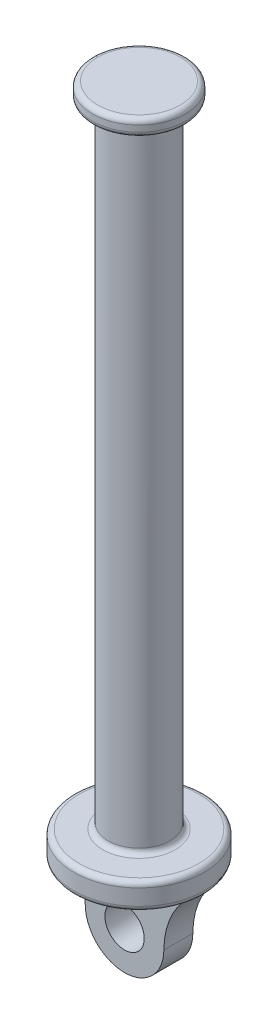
ISO-10303-21;
HEADER;
FILE_DESCRIPTION(('STEP AP214'),'2;1');
FILE_NAME('part.step','',(''),(''),'','','');
FILE_SCHEMA(('AUTOMOTIVE_DESIGN { 1 0 10303 214 1 1 1 1 }'));
ENDSEC;
DATA;
#1=APPLICATION_CONTEXT('core data for automotive mechanical design processes');
#2=APPLICATION_PROTOCOL_DEFINITION('international standard','automotive_design',2000,#1);
#3=PRODUCT_CONTEXT('',#1,'mechanical');
#4=PRODUCT('Part','Part','',(#3));
#5=PRODUCT_RELATED_PRODUCT_CATEGORY('part','',(#4));
#6=PRODUCT_DEFINITION_FORMATION('','',#4);
#7=PRODUCT_DEFINITION_CONTEXT('part definition',#1,'design');
#8=PRODUCT_DEFINITION('design','',#6,#7);
#9=PRODUCT_DEFINITION_SHAPE('','',#8);
#10=(LENGTH_UNIT() NAMED_UNIT(*) SI_UNIT(.MILLI.,.METRE.));
#11=(NAMED_UNIT(*) PLANE_ANGLE_UNIT() SI_UNIT($,.RADIAN.));
#12=(NAMED_UNIT(*) SI_UNIT($,.STERADIAN.) SOLID_ANGLE_UNIT());
#13=UNCERTAINTY_MEASURE_WITH_UNIT(LENGTH_MEASURE(1.E-05),#10,'distance_accuracy_value','');
#14=(GEOMETRIC_REPRESENTATION_CONTEXT(3) GLOBAL_UNCERTAINTY_ASSIGNED_CONTEXT((#13)) GLOBAL_UNIT_ASSIGNED_CONTEXT((#10,
#11,#12)) REPRESENTATION_CONTEXT('',''));
#15=CARTESIAN_POINT('',(0.,0.,0.));
#16=DIRECTION('',(0.,0.,1.));
#17=DIRECTION('',(1.,0.,0.));
#18=AXIS2_PLACEMENT_3D('',#15,#16,#17);
#19=CARTESIAN_POINT('',(0.,-12.7,0.));
#20=DIRECTION('',(0.,-1.,0.));
#21=DIRECTION('',(0.,0.,-1.));
#22=AXIS2_PLACEMENT_3D('',#19,#20,#21);
#23=PLANE('',#22);
#24=DIRECTION('',(-1.,0.,0.));
#25=VECTOR('',#24,1.);
#26=CARTESIAN_POINT('',(-28.5,-12.7,7.));
#27=LINE('',#26,#25);
#28=CARTESIAN_POINT('',(28.1424945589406,-12.7,7.));
#29=VERTEX_POINT('',#28);
#30=CARTESIAN_POINT('',(-28.1424945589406,-12.7,7.));
#31=VERTEX_POINT('',#30);
#32=EDGE_CURVE('E118',#29,#31,#27,.T.);
#33=ORIENTED_EDGE('',*,*,#32,.F.);
#34=CARTESIAN_POINT('',(0.,-12.7,0.));
#35=DIRECTION('',(0.,-1.,0.));
#36=DIRECTION('',(0.,0.,-1.));
#37=AXIS2_PLACEMENT_3D('',#34,#35,#36);
#38=CIRCLE('',#37,29.);
#39=EDGE_CURVE('E172',#29,#31,#38,.T.);
#40=ORIENTED_EDGE('',*,*,#39,.T.);
#41=EDGE_LOOP('',(#33,#40));
#42=FACE_BOUND('',#41,.T.);
#43=ADVANCED_FACE('F38',(#42),#23,.T.);
#44=DIRECTION('',(0.,0.,-1.));
#45=VECTOR('',#44,1.);
#46=CARTESIAN_POINT('',(-28.5,-12.7,7.));
#47=LINE('',#46,#45);
#48=CARTESIAN_POINT('',(-28.5,-12.7,5.36190264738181));
#49=VERTEX_POINT('',#48);
#50=CARTESIAN_POINT('',(-28.5,-12.7,-5.36190264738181));
#51=VERTEX_POINT('',#50);
#52=EDGE_CURVE('E127',#49,#51,#47,.T.);
#53=ORIENTED_EDGE('',*,*,#52,.F.);
#54=CARTESIAN_POINT('',(0.,-12.7,0.));
#55=DIRECTION('',(0.,-1.,0.));
#56=DIRECTION('',(0.,0.,-1.));
#57=AXIS2_PLACEMENT_3D('',#54,#55,#56);
#58=CIRCLE('',#57,29.);
#59=EDGE_CURVE('E170',#49,#51,#58,.T.);
#60=ORIENTED_EDGE('',*,*,#59,.T.);
#61=EDGE_LOOP('',(#53,#60));
#62=FACE_BOUND('',#61,.T.);
#63=ADVANCED_FACE('F290',(#62),#23,.T.);
#64=DIRECTION('',(-1.,0.,0.));
#65=VECTOR('',#64,1.);
#66=CARTESIAN_POINT('',(-28.5,-12.7,-7.));
#67=LINE('',#66,#65);
#68=CARTESIAN_POINT('',(28.1424945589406,-12.7,-7.));
#69=VERTEX_POINT('',#68);
#70=CARTESIAN_POINT('',(-28.1424945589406,-12.7,-7.));
#71=VERTEX_POINT('',#70);
#72=EDGE_CURVE('E136',#69,#71,#67,.T.);
#73=ORIENTED_EDGE('',*,*,#72,.T.);
#74=CARTESIAN_POINT('',(0.,-12.7,0.));
#75=DIRECTION('',(0.,-1.,0.));
#76=DIRECTION('',(0.,0.,-1.));
#77=AXIS2_PLACEMENT_3D('',#74,#75,#76);
#78=CIRCLE('',#77,29.);
#79=EDGE_CURVE('E168',#71,#69,#78,.T.);
#80=ORIENTED_EDGE('',*,*,#79,.T.);
#81=EDGE_LOOP('',(#73,#80));
#82=FACE_BOUND('',#81,.T.);
#83=ADVANCED_FACE('F252',(#82),#23,.T.);
#84=DIRECTION('',(0.,0.,-1.));
#85=VECTOR('',#84,1.);
#86=CARTESIAN_POINT('',(28.5,-12.7,7.));
#87=LINE('',#86,#85);
#88=CARTESIAN_POINT('',(28.5,-12.7,5.36190264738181));
#89=VERTEX_POINT('',#88);
#90=CARTESIAN_POINT('',(28.5,-12.7,-5.36190264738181));
#91=VERTEX_POINT('',#90);
#92=EDGE_CURVE('E145',#89,#91,#87,.T.);
#93=ORIENTED_EDGE('',*,*,#92,.T.);
#94=CARTESIAN_POINT('',(0.,-12.7,0.));
#95=DIRECTION('',(0.,-1.,0.));
#96=DIRECTION('',(0.,0.,-1.));
#97=AXIS2_PLACEMENT_3D('',#94,#95,#96);
#98=CIRCLE('',#97,29.);
#99=EDGE_CURVE('E166',#91,#89,#98,.T.);
#100=ORIENTED_EDGE('',*,*,#99,.T.);
#101=EDGE_LOOP('',(#93,#100));
#102=FACE_BOUND('',#101,.T.);
#103=ADVANCED_FACE('F247',(#102),#23,.T.);
#104=CARTESIAN_POINT('',(0.,305.,0.));
#105=DIRECTION('',(0.,-1.,0.));
#106=DIRECTION('',(0.,0.,-1.));
#107=AXIS2_PLACEMENT_3D('',#104,#105,#106);
#108=CYLINDRICAL_SURFACE('',#107,15.);
#109=CARTESIAN_POINT('',(0.,2.5,0.));
#110=DIRECTION('',(0.,-1.,0.));
#111=DIRECTION('',(0.,0.,-1.));
#112=AXIS2_PLACEMENT_3D('',#109,#110,#111);
#113=CIRCLE('',#112,15.);
#114=CARTESIAN_POINT('',(0.,2.5,-15.));
#115=VERTEX_POINT('',#114);
#116=EDGE_CURVE('E151',#115,#115,#113,.F.);
#117=ORIENTED_EDGE('',*,*,#116,.T.);
#118=EDGE_LOOP('',(#117));
#119=FACE_BOUND('',#118,.T.);
#120=CARTESIAN_POINT('',(0.,302.5,0.));
#121=DIRECTION('',(0.,1.,0.));
#122=DIRECTION('',(0.,0.,1.));
#123=AXIS2_PLACEMENT_3D('',#120,#121,#122);
#124=CIRCLE('',#123,15.);
#125=CARTESIAN_POINT('',(0.,302.5,15.));
#126=VERTEX_POINT('',#125);
#127=EDGE_CURVE('E148',#126,#126,#124,.F.);
#128=ORIENTED_EDGE('',*,*,#127,.T.);
#129=EDGE_LOOP('',(#128));
#130=FACE_BOUND('',#129,.T.);
#131=ADVANCED_FACE('F251',(#119,#130),#108,.T.);
#132=CARTESIAN_POINT('',(0.,313.,0.));
#133=DIRECTION('',(0.,-1.,0.));
#134=DIRECTION('',(0.,0.,-1.));
#135=AXIS2_PLACEMENT_3D('',#132,#133,#134);
#136=CYLINDRICAL_SURFACE('',#135,22.5);
#137=CARTESIAN_POINT('',(0.,307.5,0.));
#138=DIRECTION('',(0.,1.,0.));
#139=DIRECTION('',(0.,0.,1.));
#140=AXIS2_PLACEMENT_3D('',#137,#138,#139);
#141=CIRCLE('',#140,22.5);
#142=CARTESIAN_POINT('',(0.,307.5,22.5));
#143=VERTEX_POINT('',#142);
#144=EDGE_CURVE('E184',#143,#143,#141,.T.);
#145=ORIENTED_EDGE('',*,*,#144,.T.);
#146=EDGE_LOOP('',(#145));
#147=FACE_BOUND('',#146,.T.);
#148=CARTESIAN_POINT('',(0.,310.5,0.));
#149=DIRECTION('',(0.,1.,0.));
#150=DIRECTION('',(0.,0.,1.));
#151=AXIS2_PLACEMENT_3D('',#148,#149,#150);
#152=CIRCLE('',#151,22.5);
#153=CARTESIAN_POINT('',(0.,310.5,22.5));
#154=VERTEX_POINT('',#153);
#155=EDGE_CURVE('E181',#154,#154,#152,.F.);
#156=ORIENTED_EDGE('',*,*,#155,.T.);
#157=EDGE_LOOP('',(#156));
#158=FACE_BOUND('',#157,.T.);
#159=ADVANCED_FACE('F265',(#147,#158),#136,.T.);
#160=CARTESIAN_POINT('',(0.,313.,0.));
#161=DIRECTION('',(0.,1.,0.));
#162=DIRECTION('',(0.,0.,1.));
#163=AXIS2_PLACEMENT_3D('',#160,#161,#162);
#164=PLANE('',#163);
#165=CARTESIAN_POINT('',(0.,313.,0.));
#166=DIRECTION('',(0.,1.,0.));
#167=DIRECTION('',(0.,0.,1.));
#168=AXIS2_PLACEMENT_3D('',#165,#166,#167);
#169=CIRCLE('',#168,20.);
#170=CARTESIAN_POINT('',(0.,313.,20.));
#171=VERTEX_POINT('',#170);
#172=EDGE_CURVE('E187',#171,#171,#169,.T.);
#173=ORIENTED_EDGE('',*,*,#172,.T.);
#174=EDGE_LOOP('',(#173));
#175=FACE_BOUND('',#174,.T.);
#176=ADVANCED_FACE('F262',(#175),#164,.T.);
#177=CARTESIAN_POINT('',(0.,305.,0.));
#178=DIRECTION('',(0.,1.,0.));
#179=DIRECTION('',(0.,0.,1.));
#180=AXIS2_PLACEMENT_3D('',#177,#178,#179);
#181=PLANE('',#180);
#182=CARTESIAN_POINT('',(0.,305.,0.));
#183=DIRECTION('',(0.,1.,0.));
#184=DIRECTION('',(0.,0.,1.));
#185=AXIS2_PLACEMENT_3D('',#182,#183,#184);
#186=CIRCLE('',#185,17.5);
#187=CARTESIAN_POINT('',(0.,305.,17.5));
#188=VERTEX_POINT('',#187);
#189=EDGE_CURVE('E163',#188,#188,#186,.T.);
#190=ORIENTED_EDGE('',*,*,#189,.T.);
#191=EDGE_LOOP('',(#190));
#192=FACE_BOUND('',#191,.T.);
#193=CARTESIAN_POINT('',(0.,305.,0.));
#194=DIRECTION('',(0.,1.,0.));
#195=DIRECTION('',(0.,0.,1.));
#196=AXIS2_PLACEMENT_3D('',#193,#194,#195);
#197=CIRCLE('',#196,20.);
#198=CARTESIAN_POINT('',(0.,305.,20.));
#199=VERTEX_POINT('',#198);
#200=EDGE_CURVE('E160',#199,#199,#197,.F.);
#201=ORIENTED_EDGE('',*,*,#200,.T.);
#202=EDGE_LOOP('',(#201));
#203=FACE_BOUND('',#202,.T.);
#204=ADVANCED_FACE('F260',(#192,#203),#181,.F.);
#205=CARTESIAN_POINT('',(0.,-12.7,0.));
#206=DIRECTION('',(0.,1.,0.));
#207=DIRECTION('',(0.,0.,1.));
#208=AXIS2_PLACEMENT_3D('',#205,#206,#207);
#209=CYLINDRICAL_SURFACE('',#208,31.5);
#210=CARTESIAN_POINT('',(0.,-10.2,0.));
#211=DIRECTION('',(0.,-1.,0.));
#212=DIRECTION('',(0.,0.,-1.));
#213=AXIS2_PLACEMENT_3D('',#210,#211,#212);
#214=CIRCLE('',#213,31.5);
#215=CARTESIAN_POINT('',(0.,-10.2,-31.5));
#216=VERTEX_POINT('',#215);
#217=EDGE_CURVE('E178',#216,#216,#214,.F.);
#218=ORIENTED_EDGE('',*,*,#217,.T.);
#219=EDGE_LOOP('',(#218));
#220=FACE_BOUND('',#219,.T.);
#221=CARTESIAN_POINT('',(0.,-2.5,0.));
#222=DIRECTION('',(0.,-1.,0.));
#223=DIRECTION('',(0.,0.,-1.));
#224=AXIS2_PLACEMENT_3D('',#221,#222,#223);
#225=CIRCLE('',#224,31.5);
#226=CARTESIAN_POINT('',(0.,-2.5,-31.5));
#227=VERTEX_POINT('',#226);
#228=EDGE_CURVE('E175',#227,#227,#225,.T.);
#229=ORIENTED_EDGE('',*,*,#228,.T.);
#230=EDGE_LOOP('',(#229));
#231=FACE_BOUND('',#230,.T.);
#232=ADVANCED_FACE('F256',(#220,#231),#209,.T.);
#233=CARTESIAN_POINT('',(0.,0.,0.));
#234=DIRECTION('',(0.,-1.,0.));
#235=DIRECTION('',(0.,0.,-1.));
#236=AXIS2_PLACEMENT_3D('',#233,#234,#235);
#237=PLANE('',#236);
#238=CARTESIAN_POINT('',(0.,0.,0.));
#239=DIRECTION('',(0.,-1.,0.));
#240=DIRECTION('',(0.,0.,-1.));
#241=AXIS2_PLACEMENT_3D('',#238,#239,#240);
#242=CIRCLE('',#241,17.5);
#243=CARTESIAN_POINT('',(0.,0.,-17.5));
#244=VERTEX_POINT('',#243);
#245=EDGE_CURVE('E157',#244,#244,#242,.T.);
#246=ORIENTED_EDGE('',*,*,#245,.T.);
#247=EDGE_LOOP('',(#246));
#248=FACE_BOUND('',#247,.T.);
#249=CARTESIAN_POINT('',(0.,0.,0.));
#250=DIRECTION('',(0.,-1.,0.));
#251=DIRECTION('',(0.,0.,-1.));
#252=AXIS2_PLACEMENT_3D('',#249,#250,#251);
#253=CIRCLE('',#252,29.);
#254=CARTESIAN_POINT('',(0.,0.,-29.));
#255=VERTEX_POINT('',#254);
#256=EDGE_CURVE('E154',#255,#255,#253,.F.);
#257=ORIENTED_EDGE('',*,*,#256,.T.);
#258=EDGE_LOOP('',(#257));
#259=FACE_BOUND('',#258,.T.);
#260=ADVANCED_FACE('F211',(#248,#259),#237,.F.);
#261=CARTESIAN_POINT('',(56.99984056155,-37.834818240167,7.));
#262=DIRECTION('',(0.,0.,1.));
#263=DIRECTION('',(1.,0.,0.));
#264=AXIS2_PLACEMENT_3D('',#261,#262,#263);
#265=PLANE('',#264);
#266=CARTESIAN_POINT('',(56.99984056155,-37.834818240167,7.));
#267=DIRECTION('',(0.,0.,-1.));
#268=DIRECTION('',(1.,0.,0.));
#269=AXIS2_PLACEMENT_3D('',#266,#267,#268);
#270=CIRCLE('',#269,38.);
#271=CARTESIAN_POINT('',(18.99994685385,-37.744939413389,7.));
#272=VERTEX_POINT('',#271);
#273=CARTESIAN_POINT('',(28.5244055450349,-12.6723541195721,7.));
#274=VERTEX_POINT('',#273);
#275=EDGE_CURVE('E58',#272,#274,#270,.T.);
#276=ORIENTED_EDGE('',*,*,#275,.T.);
#277=CARTESIAN_POINT('',(28.5244055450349,-12.6723541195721,7.));
#278=CARTESIAN_POINT('',(28.4610869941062,-12.6815662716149,7.));
#279=CARTESIAN_POINT('',(28.3976017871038,-12.6884761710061,7.));
#280=CARTESIAN_POINT('',(28.2702981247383,-12.6976914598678,7.));
#281=CARTESIAN_POINT('',(28.2064796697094,-12.6999968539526,7.));
#282=CARTESIAN_POINT('',(28.1424945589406,-12.7,7.));
#283=B_SPLINE_CURVE_WITH_KNOTS('',3,(#277,#278,#279,#280,#281,#282),.UNSPECIFIED.,.F.,.F.,(4,2,
4),(0.,0.191580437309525,0.383160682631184),.UNSPECIFIED.);
#284=EDGE_CURVE('E11',#274,#29,#283,.T.);
#285=ORIENTED_EDGE('',*,*,#284,.T.);
#286=ORIENTED_EDGE('',*,*,#32,.T.);
#287=CARTESIAN_POINT('',(-28.1424945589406,-12.7,7.));
#288=CARTESIAN_POINT('',(-28.2064796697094,-12.6999968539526,7.));
#289=CARTESIAN_POINT('',(-28.2702981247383,-12.6976914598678,7.));
#290=CARTESIAN_POINT('',(-28.3976017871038,-12.6884761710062,7.));
#291=CARTESIAN_POINT('',(-28.4610869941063,-12.681566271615,7.));
#292=CARTESIAN_POINT('',(-28.5244055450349,-12.6723541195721,7.));
#293=B_SPLINE_CURVE_WITH_KNOTS('',3,(#287,#288,#289,#290,#291,#292),.UNSPECIFIED.,.F.,.F.,(4,2,
4),(0.,0.191580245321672,0.383160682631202),.UNSPECIFIED.);
#294=CARTESIAN_POINT('',(-28.5244055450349,-12.6723541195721,7.));
#295=VERTEX_POINT('',#294);
#296=EDGE_CURVE('E115',#31,#295,#293,.T.);
#297=ORIENTED_EDGE('',*,*,#296,.T.);
#298=CARTESIAN_POINT('',(-56.99984056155,-37.834818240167,7.));
#299=DIRECTION('',(0.,0.,-1.));
#300=DIRECTION('',(-1.,0.,0.));
#301=AXIS2_PLACEMENT_3D('',#298,#299,#300);
#302=CIRCLE('',#301,38.);
#303=CARTESIAN_POINT('',(-18.99994685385,-37.744939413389,7.));
#304=VERTEX_POINT('',#303);
#305=EDGE_CURVE('E107',#295,#304,#302,.T.);
#306=ORIENTED_EDGE('',*,*,#305,.T.);
#307=CARTESIAN_POINT('',(0.,-37.7,7.));
#308=DIRECTION('',(0.,0.,1.));
#309=DIRECTION('',(1.,0.,0.));
#310=AXIS2_PLACEMENT_3D('',#307,#308,#309);
#311=CIRCLE('',#310,19.);
#312=EDGE_CURVE('E112',#304,#272,#311,.T.);
#313=ORIENTED_EDGE('',*,*,#312,.T.);
#314=EDGE_LOOP('',(#276,#285,#286,#297,#306,#313));
#315=FACE_BOUND('',#314,.T.);
#316=CARTESIAN_POINT('',(0.,-37.7,7.));
#317=DIRECTION('',(0.,0.,1.));
#318=DIRECTION('',(1.,0.,0.));
#319=AXIS2_PLACEMENT_3D('',#316,#317,#318);
#320=CIRCLE('',#319,9.5);
#321=CARTESIAN_POINT('',(9.5,-37.7,7.));
#322=VERTEX_POINT('',#321);
#323=EDGE_CURVE('E137',#322,#322,#320,.T.);
#324=ORIENTED_EDGE('',*,*,#323,.F.);
#325=EDGE_LOOP('',(#324));
#326=FACE_BOUND('',#325,.T.);
#327=ADVANCED_FACE('F109',(#315,#326),#265,.T.);
#328=CARTESIAN_POINT('',(56.99984056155,-37.834818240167,-7.));
#329=DIRECTION('',(0.,0.,1.));
#330=DIRECTION('',(1.,0.,0.));
#331=AXIS2_PLACEMENT_3D('',#328,#329,#330);
#332=PLANE('',#331);
#333=CARTESIAN_POINT('',(56.99984056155,-37.834818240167,-7.));
#334=DIRECTION('',(0.,0.,-1.));
#335=DIRECTION('',(1.,0.,0.));
#336=AXIS2_PLACEMENT_3D('',#333,#334,#335);
#337=CIRCLE('',#336,38.);
#338=CARTESIAN_POINT('',(18.99994685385,-37.744939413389,-7.));
#339=VERTEX_POINT('',#338);
#340=CARTESIAN_POINT('',(28.5244055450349,-12.6723541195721,-7.));
#341=VERTEX_POINT('',#340);
#342=EDGE_CURVE('E66',#339,#341,#337,.T.);
#343=ORIENTED_EDGE('',*,*,#342,.F.);
#344=CARTESIAN_POINT('',(0.,-37.7,-7.));
#345=DIRECTION('',(0.,0.,1.));
#346=DIRECTION('',(1.,0.,0.));
#347=AXIS2_PLACEMENT_3D('',#344,#345,#346);
#348=CIRCLE('',#347,19.);
#349=CARTESIAN_POINT('',(-18.99994685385,-37.744939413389,-7.));
#350=VERTEX_POINT('',#349);
#351=EDGE_CURVE('E141',#350,#339,#348,.T.);
#352=ORIENTED_EDGE('',*,*,#351,.F.);
#353=CARTESIAN_POINT('',(-56.99984056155,-37.834818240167,-7.));
#354=DIRECTION('',(0.,0.,-1.));
#355=DIRECTION('',(-1.,0.,0.));
#356=AXIS2_PLACEMENT_3D('',#353,#354,#355);
#357=CIRCLE('',#356,38.);
#358=CARTESIAN_POINT('',(-28.5244055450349,-12.6723541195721,-7.));
#359=VERTEX_POINT('',#358);
#360=EDGE_CURVE('E124',#359,#350,#357,.T.);
#361=ORIENTED_EDGE('',*,*,#360,.F.);
#362=CARTESIAN_POINT('',(-28.5244055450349,-12.6723541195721,-7.));
#363=CARTESIAN_POINT('',(-28.4610869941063,-12.6815662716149,-7.));
#364=CARTESIAN_POINT('',(-28.3976017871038,-12.6884761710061,-7.));
#365=CARTESIAN_POINT('',(-28.2702981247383,-12.6976914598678,-7.));
#366=CARTESIAN_POINT('',(-28.2064796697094,-12.6999968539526,-7.));
#367=CARTESIAN_POINT('',(-28.1424945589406,-12.7,-7.));
#368=B_SPLINE_CURVE_WITH_KNOTS('',3,(#362,#363,#364,#365,#366,#367),.UNSPECIFIED.,.F.,.F.,(4,2,
4),(0.,0.191580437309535,0.383160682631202),.UNSPECIFIED.);
#369=EDGE_CURVE('E221',#359,#71,#368,.T.);
#370=ORIENTED_EDGE('',*,*,#369,.T.);
#371=ORIENTED_EDGE('',*,*,#72,.F.);
#372=CARTESIAN_POINT('',(28.1424945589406,-12.7,-7.));
#373=CARTESIAN_POINT('',(28.2064796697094,-12.6999968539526,-7.));
#374=CARTESIAN_POINT('',(28.2702981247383,-12.6976914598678,-7.));
#375=CARTESIAN_POINT('',(28.3976017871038,-12.6884761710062,-7.));
#376=CARTESIAN_POINT('',(28.4610869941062,-12.681566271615,-7.));
#377=CARTESIAN_POINT('',(28.5244055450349,-12.6723541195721,-7.));
#378=B_SPLINE_CURVE_WITH_KNOTS('',3,(#372,#373,#374,#375,#376,#377),.UNSPECIFIED.,.F.,.F.,(4,2,
4),(0.,0.191580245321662,0.383160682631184),.UNSPECIFIED.);
#379=EDGE_CURVE('E227',#69,#341,#378,.T.);
#380=ORIENTED_EDGE('',*,*,#379,.T.);
#381=EDGE_LOOP('',(#343,#352,#361,#370,#371,#380));
#382=FACE_BOUND('',#381,.T.);
#383=CARTESIAN_POINT('',(0.,-37.7,-7.));
#384=DIRECTION('',(0.,0.,1.));
#385=DIRECTION('',(1.,0.,0.));
#386=AXIS2_PLACEMENT_3D('',#383,#384,#385);
#387=CIRCLE('',#386,9.5);
#388=CARTESIAN_POINT('',(9.5,-37.7,-7.));
#389=VERTEX_POINT('',#388);
#390=EDGE_CURVE('E320',#389,#389,#387,.T.);
#391=ORIENTED_EDGE('',*,*,#390,.T.);
#392=EDGE_LOOP('',(#391));
#393=FACE_BOUND('',#392,.T.);
#394=ADVANCED_FACE('F210',(#382,#393),#332,.F.);
#395=CARTESIAN_POINT('',(56.99984056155,-37.834818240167,7.));
#396=DIRECTION('',(0.,0.,-1.));
#397=DIRECTION('',(-1.,0.,0.));
#398=AXIS2_PLACEMENT_3D('',#395,#396,#397);
#399=CYLINDRICAL_SURFACE('',#398,38.);
#400=ORIENTED_EDGE('',*,*,#342,.T.);
#401=CARTESIAN_POINT('',(28.5244055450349,-12.6723541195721,-7.));
#402=CARTESIAN_POINT('',(28.5194823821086,-12.6779260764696,-6.86361966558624));
#403=CARTESIAN_POINT('',(28.5155275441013,-12.6824042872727,-6.72717103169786));
#404=CARTESIAN_POINT('',(28.5091710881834,-12.6896043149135,-6.45421439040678));
#405=CARTESIAN_POINT('',(28.5067691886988,-12.6923264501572,-6.3177063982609));
#406=CARTESIAN_POINT('',(28.5031337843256,-12.6964470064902,-6.04466712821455));
#407=CARTESIAN_POINT('',(28.5019002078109,-12.6978455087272,-5.90813585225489));
#408=CARTESIAN_POINT('',(28.5003374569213,-12.6996173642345,-5.63503615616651));
#409=CARTESIAN_POINT('',(28.5000084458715,-12.6999905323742,-5.49846773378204));
#410=CARTESIAN_POINT('',(28.5,-12.7,-5.36190264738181));
#411=B_SPLINE_CURVE_WITH_KNOTS('',3,(#401,#402,#403,#404,#405,#406,#407,#408,#409,#410),
.UNSPECIFIED.,.F.,.F.,(4,2,2,2,4),(0.,0.4097246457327,0.819374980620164,1.22900019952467,
1.63869937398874),.UNSPECIFIED.);
#412=EDGE_CURVE('E233',#341,#91,#411,.T.);
#413=ORIENTED_EDGE('',*,*,#412,.T.);
#414=ORIENTED_EDGE('',*,*,#92,.F.);
#415=CARTESIAN_POINT('',(28.5,-12.7,5.36190264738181));
#416=CARTESIAN_POINT('',(28.5000084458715,-12.6999905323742,5.49846773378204));
#417=CARTESIAN_POINT('',(28.5003374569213,-12.6996173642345,5.63503615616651));
#418=CARTESIAN_POINT('',(28.5019002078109,-12.6978455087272,5.90813585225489));
#419=CARTESIAN_POINT('',(28.5031337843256,-12.6964470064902,6.04466712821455));
#420=CARTESIAN_POINT('',(28.5067691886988,-12.6923264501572,6.3177063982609));
#421=CARTESIAN_POINT('',(28.5091710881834,-12.6896043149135,6.45421439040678));
#422=CARTESIAN_POINT('',(28.5155275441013,-12.6824042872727,6.72717103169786));
#423=CARTESIAN_POINT('',(28.5194823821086,-12.6779260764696,6.86361966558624));
#424=CARTESIAN_POINT('',(28.5244055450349,-12.6723541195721,7.));
#425=B_SPLINE_CURVE_WITH_KNOTS('',3,(#415,#416,#417,#418,#419,#420,#421,#422,#423,#424),
.UNSPECIFIED.,.F.,.F.,(4,2,2,2,4),(0.,0.409699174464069,0.819324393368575,1.22897472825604,
1.63869937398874),.UNSPECIFIED.);
#426=EDGE_CURVE('E52',#89,#274,#425,.T.);
#427=ORIENTED_EDGE('',*,*,#426,.T.);
#428=ORIENTED_EDGE('',*,*,#275,.F.);
#429=DIRECTION('',(0.,0.,-1.));
#430=VECTOR('',#429,1.);
#431=CARTESIAN_POINT('',(18.99994685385,-37.744939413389,7.));
#432=LINE('',#431,#430);
#433=EDGE_CURVE('E128',#272,#339,#432,.T.);
#434=ORIENTED_EDGE('',*,*,#433,.T.);
#435=EDGE_LOOP('',(#400,#413,#414,#427,#428,#434));
#436=FACE_BOUND('',#435,.T.);
#437=ADVANCED_FACE('F217',(#436),#399,.F.);
#438=CARTESIAN_POINT('',(-56.99984056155,-37.834818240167,7.));
#439=DIRECTION('',(0.,0.,-1.));
#440=DIRECTION('',(-1.,0.,0.));
#441=AXIS2_PLACEMENT_3D('',#438,#439,#440);
#442=CYLINDRICAL_SURFACE('',#441,38.);
#443=ORIENTED_EDGE('',*,*,#360,.T.);
#444=DIRECTION('',(0.,0.,-1.));
#445=VECTOR('',#444,1.);
#446=CARTESIAN_POINT('',(-18.99994685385,-37.744939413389,7.));
#447=LINE('',#446,#445);
#448=EDGE_CURVE('E121',#304,#350,#447,.T.);
#449=ORIENTED_EDGE('',*,*,#448,.F.);
#450=ORIENTED_EDGE('',*,*,#305,.F.);
#451=CARTESIAN_POINT('',(-28.5244055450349,-12.6723541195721,7.));
#452=CARTESIAN_POINT('',(-28.5194823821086,-12.6779260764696,6.86361966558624));
#453=CARTESIAN_POINT('',(-28.5155275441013,-12.6824042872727,6.72717103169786));
#454=CARTESIAN_POINT('',(-28.5091710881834,-12.6896043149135,6.45421439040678));
#455=CARTESIAN_POINT('',(-28.5067691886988,-12.6923264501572,6.3177063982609));
#456=CARTESIAN_POINT('',(-28.5031337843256,-12.6964470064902,6.04466712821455));
#457=CARTESIAN_POINT('',(-28.5019002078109,-12.6978455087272,5.90813585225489));
#458=CARTESIAN_POINT('',(-28.5003374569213,-12.6996173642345,5.63503615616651));
#459=CARTESIAN_POINT('',(-28.5000084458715,-12.6999905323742,5.49846773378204));
#460=CARTESIAN_POINT('',(-28.5,-12.7,5.36190264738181));
#461=B_SPLINE_CURVE_WITH_KNOTS('',3,(#451,#452,#453,#454,#455,#456,#457,#458,#459,#460),
.UNSPECIFIED.,.F.,.F.,(4,2,2,2,4),(0.,0.409724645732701,0.819374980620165,1.22900019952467,
1.63869937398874),.UNSPECIFIED.);
#462=EDGE_CURVE('E195',#295,#49,#461,.T.);
#463=ORIENTED_EDGE('',*,*,#462,.T.);
#464=ORIENTED_EDGE('',*,*,#52,.T.);
#465=CARTESIAN_POINT('',(-28.5,-12.7,-5.36190264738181));
#466=CARTESIAN_POINT('',(-28.5000084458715,-12.6999905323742,-5.49846773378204));
#467=CARTESIAN_POINT('',(-28.5003374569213,-12.6996173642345,-5.63503615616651));
#468=CARTESIAN_POINT('',(-28.5019002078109,-12.6978455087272,-5.90813585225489));
#469=CARTESIAN_POINT('',(-28.5031337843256,-12.6964470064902,-6.04466712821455));
#470=CARTESIAN_POINT('',(-28.5067691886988,-12.6923264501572,-6.3177063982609));
#471=CARTESIAN_POINT('',(-28.5091710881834,-12.6896043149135,-6.45421439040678));
#472=CARTESIAN_POINT('',(-28.5155275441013,-12.6824042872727,-6.72717103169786));
#473=CARTESIAN_POINT('',(-28.5194823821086,-12.6779260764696,-6.86361966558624));
#474=CARTESIAN_POINT('',(-28.5244055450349,-12.6723541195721,-7.));
#475=B_SPLINE_CURVE_WITH_KNOTS('',3,(#465,#466,#467,#468,#469,#470,#471,#472,#473,#474),
.UNSPECIFIED.,.F.,.F.,(4,2,2,2,4),(0.,0.409699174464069,0.819324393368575,1.22897472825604,
1.63869937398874),.UNSPECIFIED.);
#476=EDGE_CURVE('E304',#51,#359,#475,.T.);
#477=ORIENTED_EDGE('',*,*,#476,.T.);
#478=EDGE_LOOP('',(#443,#449,#450,#463,#464,#477));
#479=FACE_BOUND('',#478,.T.);
#480=ADVANCED_FACE('F122',(#479),#442,.F.);
#481=CARTESIAN_POINT('',(0.,-37.7,7.));
#482=DIRECTION('',(0.,0.,-1.));
#483=DIRECTION('',(-1.,0.,0.));
#484=AXIS2_PLACEMENT_3D('',#481,#482,#483);
#485=CYLINDRICAL_SURFACE('',#484,19.);
#486=ORIENTED_EDGE('',*,*,#351,.T.);
#487=ORIENTED_EDGE('',*,*,#433,.F.);
#488=ORIENTED_EDGE('',*,*,#312,.F.);
#489=ORIENTED_EDGE('',*,*,#448,.T.);
#490=EDGE_LOOP('',(#486,#487,#488,#489));
#491=FACE_BOUND('',#490,.T.);
#492=ADVANCED_FACE('F130',(#491),#485,.T.);
#493=CARTESIAN_POINT('',(0.,-37.7,7.));
#494=DIRECTION('',(0.,0.,-1.));
#495=DIRECTION('',(-1.,0.,0.));
#496=AXIS2_PLACEMENT_3D('',#493,#494,#495);
#497=CYLINDRICAL_SURFACE('',#496,9.5);
#498=ORIENTED_EDGE('',*,*,#323,.T.);
#499=EDGE_LOOP('',(#498));
#500=FACE_BOUND('',#499,.T.);
#501=ORIENTED_EDGE('',*,*,#390,.F.);
#502=EDGE_LOOP('',(#501));
#503=FACE_BOUND('',#502,.T.);
#504=ADVANCED_FACE('F212',(#500,#503),#497,.F.);
#505=CARTESIAN_POINT('',(0.,2.5,0.));
#506=DIRECTION('',(0.,-1.,0.));
#507=DIRECTION('',(0.,0.,-1.));
#508=AXIS2_PLACEMENT_3D('',#505,#506,#507);
#509=TOROIDAL_SURFACE('',#508,17.5,2.5);
#510=ORIENTED_EDGE('',*,*,#245,.F.);
#511=EDGE_LOOP('',(#510));
#512=FACE_BOUND('',#511,.T.);
#513=ORIENTED_EDGE('',*,*,#116,.F.);
#514=EDGE_LOOP('',(#513));
#515=FACE_BOUND('',#514,.T.);
#516=ADVANCED_FACE('F276',(#512,#515),#509,.F.);
#517=CARTESIAN_POINT('',(0.,302.5,0.));
#518=DIRECTION('',(0.,1.,0.));
#519=DIRECTION('',(0.,0.,1.));
#520=AXIS2_PLACEMENT_3D('',#517,#518,#519);
#521=TOROIDAL_SURFACE('',#520,17.5,2.5);
#522=ORIENTED_EDGE('',*,*,#127,.F.);
#523=EDGE_LOOP('',(#522));
#524=FACE_BOUND('',#523,.T.);
#525=ORIENTED_EDGE('',*,*,#189,.F.);
#526=EDGE_LOOP('',(#525));
#527=FACE_BOUND('',#526,.T.);
#528=ADVANCED_FACE('F278',(#524,#527),#521,.F.);
#529=CARTESIAN_POINT('',(0.,-10.2,0.));
#530=DIRECTION('',(0.,-1.,0.));
#531=DIRECTION('',(0.,0.,-1.));
#532=AXIS2_PLACEMENT_3D('',#529,#530,#531);
#533=TOROIDAL_SURFACE('',#532,29.,2.5);
#534=ORIENTED_EDGE('',*,*,#217,.F.);
#535=EDGE_LOOP('',(#534));
#536=FACE_BOUND('',#535,.T.);
#537=ORIENTED_EDGE('',*,*,#296,.F.);
#538=ORIENTED_EDGE('',*,*,#39,.F.);
#539=ORIENTED_EDGE('',*,*,#284,.F.);
#540=ORIENTED_EDGE('',*,*,#426,.F.);
#541=ORIENTED_EDGE('',*,*,#99,.F.);
#542=ORIENTED_EDGE('',*,*,#412,.F.);
#543=ORIENTED_EDGE('',*,*,#379,.F.);
#544=ORIENTED_EDGE('',*,*,#79,.F.);
#545=ORIENTED_EDGE('',*,*,#369,.F.);
#546=ORIENTED_EDGE('',*,*,#476,.F.);
#547=ORIENTED_EDGE('',*,*,#59,.F.);
#548=ORIENTED_EDGE('',*,*,#462,.F.);
#549=EDGE_LOOP('',(#537,#538,#539,#540,#541,#542,#543,#544,#545,#546,#547,#548));
#550=FACE_BOUND('',#549,.T.);
#551=ADVANCED_FACE('F202',(#536,#550),#533,.T.);
#552=CARTESIAN_POINT('',(0.,-2.5,0.));
#553=DIRECTION('',(0.,-1.,0.));
#554=DIRECTION('',(0.,0.,-1.));
#555=AXIS2_PLACEMENT_3D('',#552,#553,#554);
#556=TOROIDAL_SURFACE('',#555,29.,2.5);
#557=ORIENTED_EDGE('',*,*,#256,.F.);
#558=EDGE_LOOP('',(#557));
#559=FACE_BOUND('',#558,.T.);
#560=ORIENTED_EDGE('',*,*,#228,.F.);
#561=EDGE_LOOP('',(#560));
#562=FACE_BOUND('',#561,.T.);
#563=ADVANCED_FACE('F285',(#559,#562),#556,.T.);
#564=CARTESIAN_POINT('',(0.,307.5,0.));
#565=DIRECTION('',(0.,1.,0.));
#566=DIRECTION('',(0.,0.,1.));
#567=AXIS2_PLACEMENT_3D('',#564,#565,#566);
#568=TOROIDAL_SURFACE('',#567,20.,2.5);
#569=ORIENTED_EDGE('',*,*,#200,.F.);
#570=EDGE_LOOP('',(#569));
#571=FACE_BOUND('',#570,.T.);
#572=ORIENTED_EDGE('',*,*,#144,.F.);
#573=EDGE_LOOP('',(#572));
#574=FACE_BOUND('',#573,.T.);
#575=ADVANCED_FACE('F446',(#571,#574),#568,.T.);
#576=CARTESIAN_POINT('',(0.,310.5,0.));
#577=DIRECTION('',(0.,1.,0.));
#578=DIRECTION('',(0.,0.,1.));
#579=AXIS2_PLACEMENT_3D('',#576,#577,#578);
#580=TOROIDAL_SURFACE('',#579,20.,2.5);
#581=ORIENTED_EDGE('',*,*,#155,.F.);
#582=EDGE_LOOP('',(#581));
#583=FACE_BOUND('',#582,.T.);
#584=ORIENTED_EDGE('',*,*,#172,.F.);
#585=EDGE_LOOP('',(#584));
#586=FACE_BOUND('',#585,.T.);
#587=ADVANCED_FACE('F40',(#583,#586),#580,.T.);
#588=CLOSED_SHELL('',(#43,#63,#83,#103,#131,#159,#176,#204,#232,#260,#327,#394,#437,#480,#492,
#504,#516,#528,#551,#563,#575,#587));
#589=MANIFOLD_SOLID_BREP('B2',#588);
#590=ADVANCED_BREP_SHAPE_REPRESENTATION('',(#18,#589),#14);
#591=SHAPE_DEFINITION_REPRESENTATION(#9,#590);
ENDSEC;
END-ISO-10303-21;
